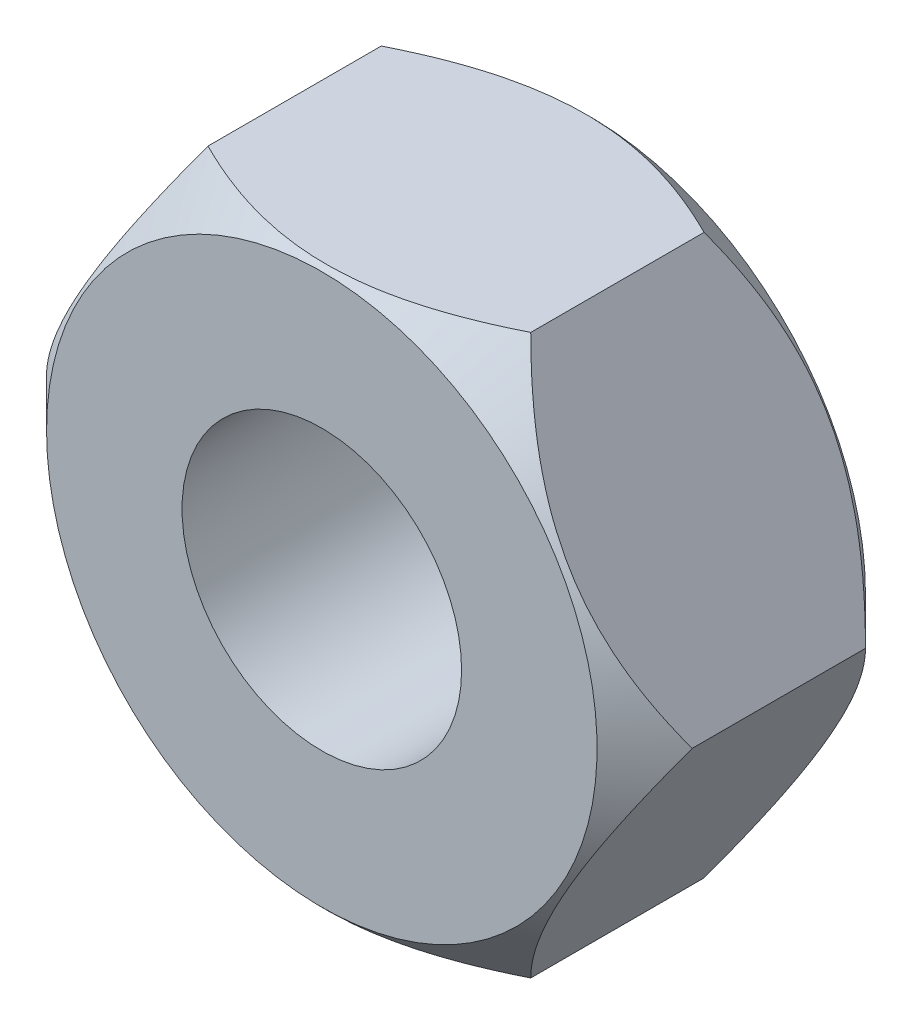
ISO-10303-21;
HEADER;
FILE_DESCRIPTION(('STEP AP214'),'2;1');
FILE_NAME('part.step','',(''),(''),'','','');
FILE_SCHEMA(('AUTOMOTIVE_DESIGN { 1 0 10303 214 1 1 1 1 }'));
ENDSEC;
DATA;
#1=APPLICATION_CONTEXT('core data for automotive mechanical design processes');
#2=APPLICATION_PROTOCOL_DEFINITION('international standard','automotive_design',2000,#1);
#3=PRODUCT_CONTEXT('',#1,'mechanical');
#4=PRODUCT('Part','Part','',(#3));
#5=PRODUCT_RELATED_PRODUCT_CATEGORY('part','',(#4));
#6=PRODUCT_DEFINITION_FORMATION('','',#4);
#7=PRODUCT_DEFINITION_CONTEXT('part definition',#1,'design');
#8=PRODUCT_DEFINITION('design','',#6,#7);
#9=PRODUCT_DEFINITION_SHAPE('','',#8);
#10=(LENGTH_UNIT() NAMED_UNIT(*) SI_UNIT(.MILLI.,.METRE.));
#11=(NAMED_UNIT(*) PLANE_ANGLE_UNIT() SI_UNIT($,.RADIAN.));
#12=(NAMED_UNIT(*) SI_UNIT($,.STERADIAN.) SOLID_ANGLE_UNIT());
#13=UNCERTAINTY_MEASURE_WITH_UNIT(LENGTH_MEASURE(1.E-05),#10,'distance_accuracy_value','');
#14=(GEOMETRIC_REPRESENTATION_CONTEXT(3) GLOBAL_UNCERTAINTY_ASSIGNED_CONTEXT((#13)) GLOBAL_UNIT_ASSIGNED_CONTEXT((#10,
#11,#12)) REPRESENTATION_CONTEXT('',''));
#15=CARTESIAN_POINT('',(0.,0.,0.));
#16=DIRECTION('',(0.,0.,1.));
#17=DIRECTION('',(1.,0.,0.));
#18=AXIS2_PLACEMENT_3D('',#15,#16,#17);
#19=CARTESIAN_POINT('',(-2.88675134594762,5.00000000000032,-4.79999999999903));
#20=DIRECTION('',(-0.866025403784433,0.500000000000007,0.));
#21=DIRECTION('',(-0.500000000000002,-0.866025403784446,0.));
#22=AXIS2_PLACEMENT_3D('',#19,#20,#21);
#23=PLANE('',#22);
#24=CARTESIAN_POINT('',(-5.77361816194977,-0.000199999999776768,-3.94988452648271));
#25=CARTESIAN_POINT('',(-5.72398176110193,0.0857727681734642,-3.9995164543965));
#26=CARTESIAN_POINT('',(-5.67396382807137,0.17240636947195,-4.04762527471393));
#27=CARTESIAN_POINT('',(-5.57309004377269,0.347124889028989,-4.14033336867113));
#28=CARTESIAN_POINT('',(-5.52223375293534,0.435210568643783,-4.18493072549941));
#29=CARTESIAN_POINT('',(-5.36782257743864,0.702658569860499,-4.31314092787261));
#30=CARTESIAN_POINT('',(-5.26296050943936,0.884284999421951,-4.39062493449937));
#31=CARTESIAN_POINT('',(-5.05149774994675,1.25054924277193,-4.52331105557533));
#32=CARTESIAN_POINT('',(-4.94495110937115,1.43509343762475,-4.57884745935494));
#33=CARTESIAN_POINT('',(-4.78337944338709,1.71494377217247,-4.6430895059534));
#34=CARTESIAN_POINT('',(-4.72928433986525,1.80863923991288,-4.66131783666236));
#35=CARTESIAN_POINT('',(-4.62063609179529,1.99682352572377,-4.69100781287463));
#36=CARTESIAN_POINT('',(-4.56608301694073,2.09131222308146,-4.70247046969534));
#37=CARTESIAN_POINT('',(-4.43314578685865,2.32156625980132,-4.72168913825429));
#38=CARTESIAN_POINT('',(-4.3546183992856,2.45757968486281,-4.72572171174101));
#39=CARTESIAN_POINT('',(-4.19770514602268,2.72936141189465,-4.71895414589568));
#40=CARTESIAN_POINT('',(-4.11931933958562,2.86512961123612,-4.70814880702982));
#41=CARTESIAN_POINT('',(-3.96328672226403,3.13538603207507,-4.6723423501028));
#42=CARTESIAN_POINT('',(-3.88564083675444,3.26987265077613,-4.64732535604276));
#43=CARTESIAN_POINT('',(-3.73168360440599,3.53653439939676,-4.58445567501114));
#44=CARTESIAN_POINT('',(-3.65537215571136,3.6687097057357,-4.54660397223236));
#45=CARTESIAN_POINT('',(-3.51990355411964,3.90334820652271,-4.46873011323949));
#46=CARTESIAN_POINT('',(-3.46044647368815,4.00633089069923,-4.43075574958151));
#47=CARTESIAN_POINT('',(-3.34259967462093,4.21044753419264,-4.34868737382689));
#48=CARTESIAN_POINT('',(-3.28420998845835,4.31158143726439,-4.30459317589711));
#49=CARTESIAN_POINT('',(-3.16868188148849,4.51168198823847,-4.21127361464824));
#50=CARTESIAN_POINT('',(-3.11154017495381,4.61065432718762,-4.16206438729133));
#51=CARTESIAN_POINT('',(-2.99831490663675,4.80676624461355,-4.05916087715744));
#52=CARTESIAN_POINT('',(-2.94223072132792,4.90390690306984,-4.00546934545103));
#53=CARTESIAN_POINT('',(-2.88663587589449,5.00020000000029,-3.94988452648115));
#54=B_SPLINE_CURVE_WITH_KNOTS('',3,(#24,#25,#26,#27,#28,#29,#30,#31,#32,#33,#34,#35,#36,#37,#38,
#39,#40,#41,#42,#43,#44,#45,#46,#47,#48,#49,#50,#51,#52,#53),.UNSPECIFIED.,.F.,.F.,(4,2,2,2,2,2,
2,2,2,2,2,2,2,2,4),(0.,0.332945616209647,0.666071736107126,1.33592065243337,1.99513262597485,
2.32409207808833,2.6530023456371,3.12358963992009,3.59434188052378,4.06562104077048,
4.53686407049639,4.91117956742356,5.28550643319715,5.65868635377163,6.03163889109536),.UNSPECIFIED.);
#55=CARTESIAN_POINT('',(-5.77350269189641,4.37150315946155E-13,-3.95000000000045));
#56=VERTEX_POINT('',#55);
#57=CARTESIAN_POINT('',(-2.88675134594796,5.00000000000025,-3.9499999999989));
#58=VERTEX_POINT('',#57);
#59=EDGE_CURVE('E200',#56,#58,#54,.T.);
#60=ORIENTED_EDGE('',*,*,#59,.F.);
#61=DIRECTION('',(0.,0.,1.));
#62=VECTOR('',#61,1.);
#63=CARTESIAN_POINT('',(-5.77350269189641,4.44089209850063E-13,-4.80000000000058));
#64=LINE('',#63,#62);
#65=CARTESIAN_POINT('',(-5.77350269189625,2.63677968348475E-13,-0.850000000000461));
#66=VERTEX_POINT('',#65);
#67=EDGE_CURVE('E44',#56,#66,#64,.T.);
#68=ORIENTED_EDGE('',*,*,#67,.T.);
#69=CARTESIAN_POINT('',(-5.77361816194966,-0.000199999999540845,-0.85011547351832));
#70=CARTESIAN_POINT('',(-5.72398176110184,0.0857727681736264,-0.800483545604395));
#71=CARTESIAN_POINT('',(-5.6739638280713,0.172406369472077,-0.752374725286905));
#72=CARTESIAN_POINT('',(-5.57309004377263,0.347124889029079,-0.65966663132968));
#73=CARTESIAN_POINT('',(-5.52223375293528,0.435210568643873,-0.615069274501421));
#74=CARTESIAN_POINT('',(-5.36782257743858,0.7026585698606,-0.486859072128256));
#75=CARTESIAN_POINT('',(-5.2629605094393,0.884284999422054,-0.409375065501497));
#76=CARTESIAN_POINT('',(-5.05149774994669,1.25054924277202,-0.27668894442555));
#77=CARTESIAN_POINT('',(-4.9449511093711,1.43509343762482,-0.22115254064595));
#78=CARTESIAN_POINT('',(-4.78337944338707,1.71494377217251,-0.156910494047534));
#79=CARTESIAN_POINT('',(-4.72928433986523,1.8086392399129,-0.138682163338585));
#80=CARTESIAN_POINT('',(-4.6206360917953,1.99682352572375,-0.108992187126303));
#81=CARTESIAN_POINT('',(-4.56608301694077,2.09131222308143,-0.0975295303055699));
#82=CARTESIAN_POINT('',(-4.43314578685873,2.32156625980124,-0.0783108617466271));
#83=CARTESIAN_POINT('',(-4.35461839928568,2.45757968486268,-0.0742782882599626));
#84=CARTESIAN_POINT('',(-4.19770514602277,2.72936141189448,-0.0810458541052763));
#85=CARTESIAN_POINT('',(-4.11931933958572,2.86512961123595,-0.0918511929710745));
#86=CARTESIAN_POINT('',(-3.96328672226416,3.13538603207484,-0.127657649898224));
#87=CARTESIAN_POINT('',(-3.88564083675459,3.26987265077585,-0.152674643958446));
#88=CARTESIAN_POINT('',(-3.73168360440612,3.53653439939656,-0.215544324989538));
#89=CARTESIAN_POINT('',(-3.65537215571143,3.66870970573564,-0.253396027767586));
#90=CARTESIAN_POINT('',(-3.5199035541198,3.90334820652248,-0.331269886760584));
#91=CARTESIAN_POINT('',(-3.46044647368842,4.00633089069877,-0.369244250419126));
#92=CARTESIAN_POINT('',(-3.3425996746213,4.21044753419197,-0.451312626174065));
#93=CARTESIAN_POINT('',(-3.28420998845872,4.31158143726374,-0.49540682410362));
#94=CARTESIAN_POINT('',(-3.16868188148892,4.51168198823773,-0.588726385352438));
#95=CARTESIAN_POINT('',(-3.11154017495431,4.61065432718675,-0.63793561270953));
#96=CARTESIAN_POINT('',(-2.9983149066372,4.80676624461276,-0.740839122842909));
#97=CARTESIAN_POINT('',(-2.94223072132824,4.90390690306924,-0.794530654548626));
#98=CARTESIAN_POINT('',(-2.88663587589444,5.00020000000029,-0.850115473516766));
#99=B_SPLINE_CURVE_WITH_KNOTS('',3,(#69,#70,#71,#72,#73,#74,#75,#76,#77,#78,#79,#80,#81,#82,#83,
#84,#85,#86,#87,#88,#89,#90,#91,#92,#93,#94,#95,#96,#97,#98),.UNSPECIFIED.,.F.,.F.,(4,2,2,2,2,2,
2,2,2,2,2,2,2,2,4),(0.,0.332945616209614,0.666071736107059,1.33592065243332,1.99513262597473,
2.32409207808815,2.65300234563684,3.12358963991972,3.59434188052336,4.06562104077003,
4.53686407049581,4.91117956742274,5.28550643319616,5.65868635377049,6.03163889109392),.UNSPECIFIED.);
#100=CARTESIAN_POINT('',(-2.88675134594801,5.00000000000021,-0.849999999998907));
#101=VERTEX_POINT('',#100);
#102=EDGE_CURVE('E131',#66,#101,#99,.T.);
#103=ORIENTED_EDGE('',*,*,#102,.T.);
#104=DIRECTION('',(0.,0.,1.));
#105=VECTOR('',#104,1.);
#106=CARTESIAN_POINT('',(-2.88675134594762,5.00000000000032,-4.79999999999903));
#107=LINE('',#106,#105);
#108=EDGE_CURVE('E11',#58,#101,#107,.T.);
#109=ORIENTED_EDGE('',*,*,#108,.F.);
#110=EDGE_LOOP('',(#60,#68,#103,#109));
#111=FACE_BOUND('',#110,.T.);
#112=ADVANCED_FACE('F40',(#111),#23,.T.);
#113=CARTESIAN_POINT('',(-2.88675134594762,5.00000000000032,-4.79999999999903));
#114=DIRECTION('',(0.,-1.00000000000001,0.));
#115=DIRECTION('',(0.999999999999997,0.,0.));
#116=AXIS2_PLACEMENT_3D('',#113,#114,#115);
#117=PLANE('',#116);
#118=DIRECTION('',(0.,0.,1.));
#119=VECTOR('',#118,1.);
#120=CARTESIAN_POINT('',(2.88675134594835,5.00000000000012,-4.79999999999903));
#121=LINE('',#120,#119);
#122=CARTESIAN_POINT('',(2.88675134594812,5.00000000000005,-3.94999999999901));
#123=VERTEX_POINT('',#122);
#124=CARTESIAN_POINT('',(2.88675134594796,5.0000000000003,-0.849999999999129));
#125=VERTEX_POINT('',#124);
#126=EDGE_CURVE('E49',#123,#125,#121,.T.);
#127=ORIENTED_EDGE('',*,*,#126,.F.);
#128=CARTESIAN_POINT('',(-5.99357629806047,5.0000000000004,-1.91818675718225));
#129=CARTESIAN_POINT('',(-5.8486546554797,5.00000000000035,-2.02944472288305));
#130=CARTESIAN_POINT('',(-5.70294865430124,5.00000000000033,-2.13969712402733));
#131=CARTESIAN_POINT('',(-5.40964860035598,5.00000000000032,-2.35773242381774));
#132=CARTESIAN_POINT('',(-5.26205410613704,5.00000000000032,-2.46551472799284));
#133=CARTESIAN_POINT('',(-4.96357882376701,5.00000000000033,-2.67891856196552));
#134=CARTESIAN_POINT('',(-4.81268146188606,5.00000000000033,-2.78451698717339));
#135=CARTESIAN_POINT('',(-4.50836938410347,5.00000000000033,-2.99200966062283));
#136=CARTESIAN_POINT('',(-4.35495484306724,5.00000000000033,-3.09390416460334));
#137=CARTESIAN_POINT('',(-4.03547909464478,5.00000000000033,-3.29939196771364));
#138=CARTESIAN_POINT('',(-3.86922792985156,5.00000000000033,-3.40269142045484));
#139=CARTESIAN_POINT('',(-3.53282354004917,5.00000000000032,-3.60283631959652));
#140=CARTESIAN_POINT('',(-3.36266966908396,5.00000000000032,-3.69968068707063));
#141=CARTESIAN_POINT('',(-3.01842041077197,5.00000000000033,-3.88484981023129));
#142=CARTESIAN_POINT('',(-2.84433858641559,5.00000000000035,-3.97319958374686));
#143=CARTESIAN_POINT('',(-2.4912729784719,5.0000000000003,-4.13940018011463));
#144=CARTESIAN_POINT('',(-2.31229154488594,5.00000000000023,-4.21725593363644));
#145=CARTESIAN_POINT('',(-1.96661147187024,5.00000000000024,-4.3527670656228));
#146=CARTESIAN_POINT('',(-1.80039807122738,5.0000000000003,-4.41164764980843));
#147=CARTESIAN_POINT('',(-1.46376298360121,5.00000000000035,-4.51610170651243));
#148=CARTESIAN_POINT('',(-1.29334102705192,5.00000000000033,-4.56167432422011));
#149=CARTESIAN_POINT('',(-0.952259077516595,5.00000000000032,-4.63629654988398));
#150=CARTESIAN_POINT('',(-0.781665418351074,5.00000000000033,-4.66564427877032));
#151=CARTESIAN_POINT('',(-0.43839223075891,5.00000000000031,-4.70720899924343));
#152=CARTESIAN_POINT('',(-0.265713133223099,5.00000000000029,-4.71942947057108));
#153=CARTESIAN_POINT('',(0.0725822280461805,5.00000000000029,-4.72571379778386));
#154=CARTESIAN_POINT('',(0.238184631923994,5.00000000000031,-4.72053199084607));
#155=CARTESIAN_POINT('',(0.568083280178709,5.00000000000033,-4.69402264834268));
#156=CARTESIAN_POINT('',(0.732379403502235,5.00000000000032,-4.67269363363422));
#157=CARTESIAN_POINT('',(1.06125983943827,5.00000000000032,-4.61472847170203));
#158=CARTESIAN_POINT('',(1.22579591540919,5.00000000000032,-4.57782321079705));
#159=CARTESIAN_POINT('',(1.55124956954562,5.00000000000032,-4.49074386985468));
#160=CARTESIAN_POINT('',(1.71216736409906,5.0000000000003,-4.44057058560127));
#161=CARTESIAN_POINT('',(2.03985820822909,5.0000000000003,-4.32572275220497));
#162=CARTESIAN_POINT('',(2.20638233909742,5.00000000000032,-4.26034591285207));
#163=CARTESIAN_POINT('',(2.53514333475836,5.00000000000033,-4.11949787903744));
#164=CARTESIAN_POINT('',(2.69737821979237,5.00000000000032,-4.04402211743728));
#165=CARTESIAN_POINT('',(3.01832951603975,5.00000000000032,-3.88476661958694));
#166=CARTESIAN_POINT('',(3.17703310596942,5.00000000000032,-3.80096125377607));
#167=CARTESIAN_POINT('',(3.49080217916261,5.00000000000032,-3.62689160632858));
#168=CARTESIAN_POINT('',(3.64586821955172,5.00000000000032,-3.53662832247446));
#169=CARTESIAN_POINT('',(3.94525494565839,5.00000000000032,-3.35549299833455));
#170=CARTESIAN_POINT('',(4.08972797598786,5.00000000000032,-3.26487142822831));
#171=CARTESIAN_POINT('',(4.37619203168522,5.00000000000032,-3.07977532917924));
#172=CARTESIAN_POINT('',(4.51818286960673,5.00000000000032,-2.98530051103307));
#173=CARTESIAN_POINT('',(4.79886466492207,5.00000000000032,-2.79395544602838));
#174=CARTESIAN_POINT('',(4.9375729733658,5.00000000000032,-2.69711055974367));
#175=CARTESIAN_POINT('',(5.21308736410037,5.00000000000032,-2.50082800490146));
#176=CARTESIAN_POINT('',(5.34989396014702,5.00000000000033,-2.40139105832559));
#177=CARTESIAN_POINT('',(5.48590295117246,5.00000000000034,-2.30089323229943));
#178=B_SPLINE_CURVE_WITH_KNOTS('',3,(#128,#129,#130,#131,#132,#133,#134,#135,#136,#137,#138,
#139,#140,#141,#142,#143,#144,#145,#146,#147,#148,#149,#150,#151,#152,#153,#154,#155,#156,#157,
#158,#159,#160,#161,#162,#163,#164,#165,#166,#167,#168,#169,#170,#171,#172,#173,#174,#175,#176,
#177),.UNSPECIFIED.,.F.,.F.,(4,2,2,2,2,2,2,2,2,2,2,2,2,2,2,2,2,2,2,2,2,2,2,2,4),(0.,
0.548121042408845,1.09637264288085,1.648856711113,2.20130256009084,2.78837599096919,
3.37554730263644,3.96093263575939,4.54604195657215,5.07458825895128,5.60316850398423,
6.12168301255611,6.64009215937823,7.13632490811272,7.63260311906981,8.13783126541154,
8.6430291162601,9.17931060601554,9.71583544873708,10.2540654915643,10.7922125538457,
11.3037682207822,11.8153623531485,12.3228440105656,12.8301857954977),.UNSPECIFIED.);
#179=EDGE_CURVE('E99',#123,#58,#178,.F.);
#180=ORIENTED_EDGE('',*,*,#179,.T.);
#181=ORIENTED_EDGE('',*,*,#108,.T.);
#182=CARTESIAN_POINT('',(-5.99357629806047,5.00000000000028,-2.88181324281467));
#183=CARTESIAN_POINT('',(-5.84865465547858,5.00000000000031,-2.77055527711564));
#184=CARTESIAN_POINT('',(-5.70294865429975,5.00000000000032,-2.66030287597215));
#185=CARTESIAN_POINT('',(-5.40964860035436,5.00000000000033,-2.44226757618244));
#186=CARTESIAN_POINT('',(-5.26205410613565,5.00000000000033,-2.33448527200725));
#187=CARTESIAN_POINT('',(-4.96357882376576,5.00000000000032,-2.12108143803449));
#188=CARTESIAN_POINT('',(-4.81268146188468,5.00000000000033,-2.01548301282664));
#189=CARTESIAN_POINT('',(-4.50836938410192,5.00000000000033,-1.80799033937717));
#190=CARTESIAN_POINT('',(-4.35495484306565,5.00000000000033,-1.70609583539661));
#191=CARTESIAN_POINT('',(-4.03547909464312,5.00000000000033,-1.50060803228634));
#192=CARTESIAN_POINT('',(-3.86922792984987,5.00000000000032,-1.39730857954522));
#193=CARTESIAN_POINT('',(-3.53282354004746,5.00000000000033,-1.19716368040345));
#194=CARTESIAN_POINT('',(-3.36266966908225,5.00000000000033,-1.1003193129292));
#195=CARTESIAN_POINT('',(-3.01842041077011,5.00000000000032,-0.915150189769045));
#196=CARTESIAN_POINT('',(-2.84433858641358,5.00000000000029,-0.826800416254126));
#197=CARTESIAN_POINT('',(-2.49127297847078,5.00000000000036,-0.660599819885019));
#198=CARTESIAN_POINT('',(-2.31229154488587,5.00000000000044,-0.582744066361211));
#199=CARTESIAN_POINT('',(-1.96661147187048,5.00000000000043,-0.447232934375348));
#200=CARTESIAN_POINT('',(-1.80039807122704,5.00000000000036,-0.38835235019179));
#201=CARTESIAN_POINT('',(-1.46376298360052,5.00000000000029,-0.283898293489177));
#202=CARTESIAN_POINT('',(-1.29334102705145,5.0000000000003,-0.238325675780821));
#203=CARTESIAN_POINT('',(-0.952259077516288,5.00000000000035,-0.163703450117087));
#204=CARTESIAN_POINT('',(-0.781665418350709,5.00000000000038,-0.134355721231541));
#205=CARTESIAN_POINT('',(-0.438392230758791,5.00000000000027,-0.0927910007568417));
#206=CARTESIAN_POINT('',(-0.265713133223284,5.00000000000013,-0.0805705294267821));
#207=CARTESIAN_POINT('',(0.0725822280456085,5.00000000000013,-0.074286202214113));
#208=CARTESIAN_POINT('',(0.238184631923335,5.00000000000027,-0.0794680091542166));
#209=CARTESIAN_POINT('',(0.568083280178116,5.00000000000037,-0.105977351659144));
#210=CARTESIAN_POINT('',(0.732379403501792,5.00000000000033,-0.127306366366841));
#211=CARTESIAN_POINT('',(1.06125983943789,5.00000000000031,-0.185271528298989));
#212=CARTESIAN_POINT('',(1.22579591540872,5.00000000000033,-0.222176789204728));
#213=CARTESIAN_POINT('',(1.55124956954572,5.00000000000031,-0.309256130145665));
#214=CARTESIAN_POINT('',(1.71216736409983,5.00000000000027,-0.359429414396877));
#215=CARTESIAN_POINT('',(2.03985820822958,5.00000000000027,-0.474277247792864));
#216=CARTESIAN_POINT('',(2.20638233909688,5.00000000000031,-0.539654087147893));
#217=CARTESIAN_POINT('',(2.53514333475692,5.00000000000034,-0.68050212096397));
#218=CARTESIAN_POINT('',(2.69737821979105,5.00000000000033,-0.755977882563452));
#219=CARTESIAN_POINT('',(3.01832951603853,5.00000000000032,-0.915233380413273));
#220=CARTESIAN_POINT('',(3.17703310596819,5.00000000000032,-0.999038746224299));
#221=CARTESIAN_POINT('',(3.49080217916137,5.00000000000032,-1.17310839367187));
#222=CARTESIAN_POINT('',(3.64586821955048,5.00000000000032,-1.26337167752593));
#223=CARTESIAN_POINT('',(3.9452549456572,5.00000000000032,-1.44450700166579));
#224=CARTESIAN_POINT('',(4.08972797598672,5.00000000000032,-1.53512857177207));
#225=CARTESIAN_POINT('',(4.37619203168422,5.00000000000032,-1.72022467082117));
#226=CARTESIAN_POINT('',(4.51818286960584,5.00000000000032,-1.81469948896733));
#227=CARTESIAN_POINT('',(4.79886466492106,5.00000000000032,-2.00604455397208));
#228=CARTESIAN_POINT('',(4.93757297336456,5.00000000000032,-2.10288944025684));
#229=CARTESIAN_POINT('',(5.21308736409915,5.00000000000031,-2.29917199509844));
#230=CARTESIAN_POINT('',(5.34989396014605,5.0000000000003,-2.39860894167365));
#231=CARTESIAN_POINT('',(5.48590295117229,5.00000000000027,-2.49910676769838));
#232=B_SPLINE_CURVE_WITH_KNOTS('',3,(#182,#183,#184,#185,#186,#187,#188,#189,#190,#191,#192,
#193,#194,#195,#196,#197,#198,#199,#200,#201,#202,#203,#204,#205,#206,#207,#208,#209,#210,#211,
#212,#213,#214,#215,#216,#217,#218,#219,#220,#221,#222,#223,#224,#225,#226,#227,#228,#229,#230,
#231),.UNSPECIFIED.,.F.,.F.,(4,2,2,2,2,2,2,2,2,2,2,2,2,2,2,2,2,2,2,2,2,2,2,2,4),(0.,
0.548121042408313,1.0963726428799,1.64885671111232,2.20130256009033,2.78837599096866,
3.37554730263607,3.96093263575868,4.5460419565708,5.07458825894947,5.60316850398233,
6.12168301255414,6.64009215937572,7.13632490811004,7.63260311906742,8.13783126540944,
8.6430291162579,9.17931060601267,9.71583544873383,10.2540654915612,10.7922125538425,
11.3037682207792,11.8153623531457,12.3228440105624,12.8301857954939),.UNSPECIFIED.);
#233=EDGE_CURVE('E139',#125,#101,#232,.F.);
#234=ORIENTED_EDGE('',*,*,#233,.F.);
#235=EDGE_LOOP('',(#127,#180,#181,#234));
#236=FACE_BOUND('',#235,.T.);
#237=ADVANCED_FACE('F183',(#236),#117,.F.);
#238=CARTESIAN_POINT('',(2.88675134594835,5.00000000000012,-4.79999999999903));
#239=DIRECTION('',(-0.866025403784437,-0.500000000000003,0.));
#240=DIRECTION('',(0.499999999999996,-0.866025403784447,0.));
#241=AXIS2_PLACEMENT_3D('',#238,#239,#240);
#242=PLANE('',#241);
#243=DIRECTION('',(0.,0.,1.));
#244=VECTOR('',#243,1.);
#245=CARTESIAN_POINT('',(5.77350269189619,2.0122792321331E-13,-4.80000000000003));
#246=LINE('',#245,#244);
#247=CARTESIAN_POINT('',(5.77350269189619,1.66533453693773E-13,-3.95000000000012));
#248=VERTEX_POINT('',#247);
#249=CARTESIAN_POINT('',(5.77350269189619,1.73472347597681E-13,-0.850000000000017));
#250=VERTEX_POINT('',#249);
#251=EDGE_CURVE('E108',#248,#250,#246,.T.);
#252=ORIENTED_EDGE('',*,*,#251,.F.);
#253=CARTESIAN_POINT('',(5.77361816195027,-0.000199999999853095,-3.94988452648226));
#254=CARTESIAN_POINT('',(5.72398176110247,0.0857727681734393,-3.99951645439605));
#255=CARTESIAN_POINT('',(5.67396382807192,0.172406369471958,-4.04762527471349));
#256=CARTESIAN_POINT('',(5.57309004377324,0.347124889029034,-4.14033336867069));
#257=CARTESIAN_POINT('',(5.52223375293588,0.435210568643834,-4.18493072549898));
#258=CARTESIAN_POINT('',(5.36782257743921,0.702658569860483,-4.31314092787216));
#259=CARTESIAN_POINT('',(5.26296050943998,0.884284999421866,-4.39062493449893));
#260=CARTESIAN_POINT('',(5.05149774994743,1.25054924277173,-4.52331105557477));
#261=CARTESIAN_POINT('',(4.94495110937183,1.43509343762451,-4.57884745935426));
#262=CARTESIAN_POINT('',(4.78337944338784,1.71494377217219,-4.64308950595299));
#263=CARTESIAN_POINT('',(4.72928433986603,1.80863923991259,-4.66131783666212));
#264=CARTESIAN_POINT('',(4.62063609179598,1.99682352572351,-4.69100781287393));
#265=CARTESIAN_POINT('',(4.56608301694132,2.09131222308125,-4.70247046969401));
#266=CARTESIAN_POINT('',(4.43314578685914,2.32156625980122,-4.72168913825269));
#267=CARTESIAN_POINT('',(4.35461839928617,2.45757968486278,-4.7257217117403));
#268=CARTESIAN_POINT('',(4.19770514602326,2.7293614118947,-4.71895414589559));
#269=CARTESIAN_POINT('',(4.11931933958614,2.86512961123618,-4.70814880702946));
#270=CARTESIAN_POINT('',(3.96328672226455,3.13538603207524,-4.67234235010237));
#271=CARTESIAN_POINT('',(3.88564083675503,3.26987265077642,-4.64732535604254));
#272=CARTESIAN_POINT('',(3.73168360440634,3.53653439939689,-4.58445567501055));
#273=CARTESIAN_POINT('',(3.65537215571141,3.66870970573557,-4.54660397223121));
#274=CARTESIAN_POINT('',(3.51990355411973,3.9033482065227,-4.46873011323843));
#275=CARTESIAN_POINT('',(3.46044647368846,4.00633089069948,-4.43075574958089));
#276=CARTESIAN_POINT('',(3.34259967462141,4.21044753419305,-4.34868737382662));
#277=CARTESIAN_POINT('',(3.28420998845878,4.3115814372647,-4.30459317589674));
#278=CARTESIAN_POINT('',(3.16868188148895,4.51168198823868,-4.2112736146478));
#279=CARTESIAN_POINT('',(3.11154017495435,4.61065432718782,-4.1620643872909));
#280=CARTESIAN_POINT('',(2.99831490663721,4.8067662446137,-4.05916087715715));
#281=CARTESIAN_POINT('',(2.94223072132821,4.90390690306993,-4.00546934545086));
#282=CARTESIAN_POINT('',(2.88663587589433,5.0002000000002,-3.94988452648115));
#283=B_SPLINE_CURVE_WITH_KNOTS('',3,(#253,#254,#255,#256,#257,#258,#259,#260,#261,#262,#263,
#264,#265,#266,#267,#268,#269,#270,#271,#272,#273,#274,#275,#276,#277,#278,#279,#280,#281,#282),
.UNSPECIFIED.,.F.,.F.,(4,2,2,2,2,2,2,2,2,2,2,2,2,2,4),(0.,0.332945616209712,0.666071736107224,
1.3359206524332,1.99513262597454,2.32409207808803,2.65300234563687,3.12358963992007,
3.59434188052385,4.06562104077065,4.53686407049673,4.91117956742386,5.28550643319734,
5.6586863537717,6.03163889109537),.UNSPECIFIED.);
#284=EDGE_CURVE('E93',#248,#123,#283,.T.);
#285=ORIENTED_EDGE('',*,*,#284,.T.);
#286=ORIENTED_EDGE('',*,*,#126,.T.);
#287=CARTESIAN_POINT('',(5.77361816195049,-0.000199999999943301,-0.850115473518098));
#288=CARTESIAN_POINT('',(5.72398176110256,0.0857727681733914,-0.800483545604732));
#289=CARTESIAN_POINT('',(5.67396382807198,0.172406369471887,-0.752374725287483));
#290=CARTESIAN_POINT('',(5.57309004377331,0.347124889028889,-0.659666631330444));
#291=CARTESIAN_POINT('',(5.52223375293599,0.435210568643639,-0.615069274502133));
#292=CARTESIAN_POINT('',(5.36782257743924,0.702658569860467,-0.486859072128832));
#293=CARTESIAN_POINT('',(5.26296050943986,0.884284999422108,-0.409375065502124));
#294=CARTESIAN_POINT('',(5.05149774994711,1.25054924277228,-0.276688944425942));
#295=CARTESIAN_POINT('',(4.94495110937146,1.4350934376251,-0.221152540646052));
#296=CARTESIAN_POINT('',(4.78337944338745,1.71494377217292,-0.156910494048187));
#297=CARTESIAN_POINT('',(4.72928433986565,1.80863923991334,-0.138682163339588));
#298=CARTESIAN_POINT('',(4.62063609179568,1.99682352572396,-0.108992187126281));
#299=CARTESIAN_POINT('',(4.56608301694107,2.09131222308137,-0.0975295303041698));
#300=CARTESIAN_POINT('',(4.43314578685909,2.32156625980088,-0.078310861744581));
#301=CARTESIAN_POINT('',(4.35461839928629,2.45757968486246,-0.0742782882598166));
#302=CARTESIAN_POINT('',(4.19770514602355,2.72936141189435,-0.0810458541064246));
#303=CARTESIAN_POINT('',(4.11931933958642,2.86512961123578,-0.0918511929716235));
#304=CARTESIAN_POINT('',(3.96328672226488,3.1353860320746,-0.127657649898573));
#305=CARTESIAN_POINT('',(3.88564083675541,3.26987265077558,-0.152674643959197));
#306=CARTESIAN_POINT('',(3.73168360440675,3.53653439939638,-0.215544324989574));
#307=CARTESIAN_POINT('',(3.6553721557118,3.66870970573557,-0.253396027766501));
#308=CARTESIAN_POINT('',(3.51990355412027,3.90334820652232,-0.331269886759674));
#309=CARTESIAN_POINT('',(3.46044647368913,4.00633089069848,-0.369244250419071));
#310=CARTESIAN_POINT('',(3.34259967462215,4.21044753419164,-0.451312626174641));
#311=CARTESIAN_POINT('',(3.28420998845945,4.31158143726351,-0.495406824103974));
#312=CARTESIAN_POINT('',(3.16868188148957,4.51168198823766,-0.58872638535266));
#313=CARTESIAN_POINT('',(3.11154017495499,4.61065432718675,-0.637935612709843));
#314=CARTESIAN_POINT('',(2.99831490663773,4.80676624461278,-0.740839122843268));
#315=CARTESIAN_POINT('',(2.9422307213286,4.90390690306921,-0.794530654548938));
#316=CARTESIAN_POINT('',(2.88663587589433,5.00020000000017,-0.850115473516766));
#317=B_SPLINE_CURVE_WITH_KNOTS('',3,(#287,#288,#289,#290,#291,#292,#293,#294,#295,#296,#297,
#298,#299,#300,#301,#302,#303,#304,#305,#306,#307,#308,#309,#310,#311,#312,#313,#314,#315,#316),
.UNSPECIFIED.,.F.,.F.,(4,2,2,2,2,2,2,2,2,2,2,2,2,2,4),(0.,0.332945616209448,0.666071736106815,
1.33592065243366,1.99513262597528,2.32409207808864,2.65300234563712,3.12358963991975,
3.59434188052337,4.06562104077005,4.53686407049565,4.91117956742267,5.28550643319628,
5.65868635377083,6.03163889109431),.UNSPECIFIED.);
#318=EDGE_CURVE('E115',#250,#125,#317,.T.);
#319=ORIENTED_EDGE('',*,*,#318,.F.);
#320=EDGE_LOOP('',(#252,#285,#286,#319));
#321=FACE_BOUND('',#320,.T.);
#322=ADVANCED_FACE('F113',(#321),#242,.F.);
#323=CARTESIAN_POINT('',(5.77350269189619,2.0122792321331E-13,-4.80000000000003));
#324=DIRECTION('',(-0.866025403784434,0.500000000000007,0.));
#325=DIRECTION('',(-0.500000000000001,-0.866025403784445,0.));
#326=AXIS2_PLACEMENT_3D('',#323,#324,#325);
#327=PLANE('',#326);
#328=DIRECTION('',(0.,0.,1.));
#329=VECTOR('',#328,1.);
#330=CARTESIAN_POINT('',(2.88675134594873,-5.00000000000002,-4.80000000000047));
#331=LINE('',#330,#329);
#332=CARTESIAN_POINT('',(2.88675134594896,-4.99999999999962,-3.95000000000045));
#333=VERTEX_POINT('',#332);
#334=CARTESIAN_POINT('',(2.88675134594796,-4.99999999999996,-0.85000000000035));
#335=VERTEX_POINT('',#334);
#336=EDGE_CURVE('E110',#333,#335,#331,.T.);
#337=ORIENTED_EDGE('',*,*,#336,.F.);
#338=CARTESIAN_POINT('',(2.88663587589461,-5.00019999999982,-3.94988452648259));
#339=CARTESIAN_POINT('',(2.93627227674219,-4.91422723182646,-3.99951645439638));
#340=CARTESIAN_POINT('',(2.98629020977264,-4.82759363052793,-4.04762527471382));
#341=CARTESIAN_POINT('',(3.08716399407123,-4.65287511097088,-4.140333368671));
#342=CARTESIAN_POINT('',(3.1380202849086,-4.56478943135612,-4.18493072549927));
#343=CARTESIAN_POINT('',(3.29243146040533,-4.29734143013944,-4.31314092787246));
#344=CARTESIAN_POINT('',(3.39729352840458,-4.11571500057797,-4.39062493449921));
#345=CARTESIAN_POINT('',(3.60875628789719,-3.74945075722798,-4.5233110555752));
#346=CARTESIAN_POINT('',(3.71530292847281,-3.56490656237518,-4.57884745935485));
#347=CARTESIAN_POINT('',(3.87687459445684,-3.28505622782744,-4.64308950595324));
#348=CARTESIAN_POINT('',(3.93096969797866,-3.19136076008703,-4.66131783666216));
#349=CARTESIAN_POINT('',(4.03961794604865,-3.0031764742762,-4.69100781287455));
#350=CARTESIAN_POINT('',(4.09417102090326,-2.90868777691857,-4.70247046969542));
#351=CARTESIAN_POINT('',(4.22710825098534,-2.67843374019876,-4.72168913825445));
#352=CARTESIAN_POINT('',(4.3056356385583,-2.54242031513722,-4.72572171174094));
#353=CARTESIAN_POINT('',(4.4625488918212,-2.27063858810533,-4.7189541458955));
#354=CARTESIAN_POINT('',(4.54093469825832,-2.13487038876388,-4.70814880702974));
#355=CARTESIAN_POINT('',(4.69696731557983,-1.86461396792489,-4.67234235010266));
#356=CARTESIAN_POINT('',(4.77461320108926,-1.73012734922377,-4.64732535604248));
#357=CARTESIAN_POINT('',(4.92857043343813,-1.46346560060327,-4.58445567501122));
#358=CARTESIAN_POINT('',(5.00488188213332,-1.3312902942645,-4.54660397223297));
#359=CARTESIAN_POINT('',(5.14035048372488,-1.09665179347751,-4.46873011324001));
#360=CARTESIAN_POINT('',(5.19980756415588,-0.993669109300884,-4.43075574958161));
#361=CARTESIAN_POINT('',(5.31765436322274,-0.789552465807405,-4.34868737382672));
#362=CARTESIAN_POINT('',(5.37604404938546,-0.688418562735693,-4.30459317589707));
#363=CARTESIAN_POINT('',(5.49157215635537,-0.488318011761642,-4.21127361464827));
#364=CARTESIAN_POINT('',(5.54871386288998,-0.389345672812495,-4.16206438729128));
#365=CARTESIAN_POINT('',(5.66193913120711,-0.193233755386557,-4.05916087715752));
#366=CARTESIAN_POINT('',(5.71802331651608,-0.0960930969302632,-4.00546934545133));
#367=CARTESIAN_POINT('',(5.77361816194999,0.000200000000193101,-3.94988452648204));
#368=B_SPLINE_CURVE_WITH_KNOTS('',3,(#338,#339,#340,#341,#342,#343,#344,#345,#346,#347,#348,
#349,#350,#351,#352,#353,#354,#355,#356,#357,#358,#359,#360,#361,#362,#363,#364,#365,#366,#367),
.UNSPECIFIED.,.F.,.F.,(4,2,2,2,2,2,2,2,2,2,2,2,2,2,4),(0.,0.332945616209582,0.666071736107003,
1.33592065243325,1.99513262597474,2.3240920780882,2.65300234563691,3.12358963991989,
3.59434188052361,4.06562104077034,4.53686407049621,4.9111795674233,5.28550643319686,
5.65868635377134,6.03163889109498),.UNSPECIFIED.);
#369=EDGE_CURVE('E97',#333,#248,#368,.T.);
#370=ORIENTED_EDGE('',*,*,#369,.T.);
#371=ORIENTED_EDGE('',*,*,#251,.T.);
#372=CARTESIAN_POINT('',(2.88663587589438,-5.00020000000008,-0.85011547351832));
#373=CARTESIAN_POINT('',(2.93627227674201,-4.91422723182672,-0.800483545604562));
#374=CARTESIAN_POINT('',(2.98629020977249,-4.8275936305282,-0.752374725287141));
#375=CARTESIAN_POINT('',(3.08716399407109,-4.65287511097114,-0.659666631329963));
#376=CARTESIAN_POINT('',(3.13802028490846,-4.56478943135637,-0.615069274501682));
#377=CARTESIAN_POINT('',(3.29243146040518,-4.29734143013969,-0.486859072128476));
#378=CARTESIAN_POINT('',(3.39729352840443,-4.11571500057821,-0.409375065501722));
#379=CARTESIAN_POINT('',(3.60875628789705,-3.74945075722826,-0.276688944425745));
#380=CARTESIAN_POINT('',(3.71530292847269,-3.5649065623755,-0.221152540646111));
#381=CARTESIAN_POINT('',(3.87687459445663,-3.28505622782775,-0.156910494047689));
#382=CARTESIAN_POINT('',(3.93096969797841,-3.19136076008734,-0.138682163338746));
#383=CARTESIAN_POINT('',(4.03961794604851,-3.00317647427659,-0.108992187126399));
#384=CARTESIAN_POINT('',(4.09417102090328,-2.90868777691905,-0.0975295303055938));
#385=CARTESIAN_POINT('',(4.22710825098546,-2.67843374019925,-0.0783108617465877));
#386=CARTESIAN_POINT('',(4.30563563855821,-2.54242031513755,-0.0742782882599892));
#387=CARTESIAN_POINT('',(4.46254889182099,-2.2706385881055,-0.081045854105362));
#388=CARTESIAN_POINT('',(4.54093469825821,-2.13487038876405,-0.091851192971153));
#389=CARTESIAN_POINT('',(4.69696731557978,-1.86461396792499,-0.127657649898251));
#390=CARTESIAN_POINT('',(4.77461320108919,-1.7301273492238,-0.15267464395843));
#391=CARTESIAN_POINT('',(4.92857043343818,-1.46346560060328,-0.215544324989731));
#392=CARTESIAN_POINT('',(5.00488188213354,-1.33129029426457,-0.253396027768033));
#393=CARTESIAN_POINT('',(5.14035048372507,-1.09665179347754,-0.331269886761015));
#394=CARTESIAN_POINT('',(5.19980756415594,-0.993669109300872,-0.369244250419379));
#395=CARTESIAN_POINT('',(5.3176543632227,-0.789552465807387,-0.451312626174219));
#396=CARTESIAN_POINT('',(5.37604404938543,-0.688418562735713,-0.495406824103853));
#397=CARTESIAN_POINT('',(5.49157215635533,-0.488318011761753,-0.588726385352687));
#398=CARTESIAN_POINT('',(5.5487138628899,-0.389345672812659,-0.637935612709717));
#399=CARTESIAN_POINT('',(5.66193913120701,-0.193233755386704,-0.740839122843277));
#400=CARTESIAN_POINT('',(5.718023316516,-0.0960930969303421,-0.794530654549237));
#401=CARTESIAN_POINT('',(5.77361816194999,0.000200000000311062,-0.850115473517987));
#402=B_SPLINE_CURVE_WITH_KNOTS('',3,(#372,#373,#374,#375,#376,#377,#378,#379,#380,#381,#382,
#383,#384,#385,#386,#387,#388,#389,#390,#391,#392,#393,#394,#395,#396,#397,#398,#399,#400,#401),
.UNSPECIFIED.,.F.,.F.,(4,2,2,2,2,2,2,2,2,2,2,2,2,2,4),(0.,0.332945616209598,0.666071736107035,
1.33592065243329,1.9951326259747,2.32409207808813,2.65300234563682,3.12358963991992,
3.59434188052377,4.06562104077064,4.53686407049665,4.91117956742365,5.28550643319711,
5.65868635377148,6.03163889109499),.UNSPECIFIED.);
#403=EDGE_CURVE('E172',#335,#250,#402,.T.);
#404=ORIENTED_EDGE('',*,*,#403,.F.);
#405=EDGE_LOOP('',(#337,#370,#371,#404));
#406=FACE_BOUND('',#405,.T.);
#407=ADVANCED_FACE('F106',(#406),#327,.F.);
#408=CARTESIAN_POINT('',(-2.88675134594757,-4.99999999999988,-4.80000000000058));
#409=DIRECTION('',(0.,-1.00000000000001,0.));
#410=DIRECTION('',(0.999999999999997,0.,0.));
#411=AXIS2_PLACEMENT_3D('',#408,#409,#410);
#412=PLANE('',#411);
#413=CARTESIAN_POINT('',(-5.99357629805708,-4.9999999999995,-1.91818675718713));
#414=CARTESIAN_POINT('',(-5.84865465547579,-4.99999999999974,-2.02944472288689));
#415=CARTESIAN_POINT('',(-5.70294865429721,-4.99999999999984,-2.13969712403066));
#416=CARTESIAN_POINT('',(-5.40964860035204,-4.99999999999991,-2.35773242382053));
#417=CARTESIAN_POINT('',(-5.2620541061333,-4.99999999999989,-2.4655147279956));
#418=CARTESIAN_POINT('',(-4.96357882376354,-4.99999999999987,-2.67891856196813));
#419=CARTESIAN_POINT('',(-4.81268146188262,-4.99999999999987,-2.78451698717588));
#420=CARTESIAN_POINT('',(-4.50836938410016,-4.99999999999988,-2.99200966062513));
#421=CARTESIAN_POINT('',(-4.35495484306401,-4.99999999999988,-3.09390416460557));
#422=CARTESIAN_POINT('',(-4.03547909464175,-4.99999999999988,-3.29939196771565));
#423=CARTESIAN_POINT('',(-3.86922792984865,-4.99999999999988,-3.4026914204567));
#424=CARTESIAN_POINT('',(-3.53282354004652,-4.99999999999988,-3.60283631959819));
#425=CARTESIAN_POINT('',(-3.36266966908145,-4.99999999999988,-3.69968068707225));
#426=CARTESIAN_POINT('',(-3.01842041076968,-4.99999999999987,-3.88484981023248));
#427=CARTESIAN_POINT('',(-2.84433858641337,-4.99999999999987,-3.97319958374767));
#428=CARTESIAN_POINT('',(-2.49127297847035,-4.99999999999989,-4.13940018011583));
#429=CARTESIAN_POINT('',(-2.31229154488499,-4.99999999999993,-4.21725593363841));
#430=CARTESIAN_POINT('',(-1.96661147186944,-4.99999999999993,-4.35276706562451));
#431=CARTESIAN_POINT('',(-1.80039807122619,-4.9999999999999,-4.41164764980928));
#432=CARTESIAN_POINT('',(-1.46376298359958,-4.99999999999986,-4.5161017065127));
#433=CARTESIAN_POINT('',(-1.29334102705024,-4.99999999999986,-4.56167432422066));
#434=CARTESIAN_POINT('',(-0.952259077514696,-4.9999999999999,-4.63629654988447));
#435=CARTESIAN_POINT('',(-0.781665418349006,-4.99999999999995,-4.66564427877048));
#436=CARTESIAN_POINT('',(-0.438392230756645,-4.99999999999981,-4.70720899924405));
#437=CARTESIAN_POINT('',(-0.265713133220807,-4.99999999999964,-4.71942947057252));
#438=CARTESIAN_POINT('',(0.0725822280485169,-4.99999999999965,-4.72571379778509));
#439=CARTESIAN_POINT('',(0.238184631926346,-4.99999999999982,-4.72053199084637));
#440=CARTESIAN_POINT('',(0.568083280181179,-4.99999999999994,-4.69402264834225));
#441=CARTESIAN_POINT('',(0.732379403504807,-4.99999999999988,-4.67269363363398));
#442=CARTESIAN_POINT('',(1.06125983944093,-4.99999999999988,-4.61472847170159));
#443=CARTESIAN_POINT('',(1.22579591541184,-4.99999999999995,-4.57782321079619));
#444=CARTESIAN_POINT('',(1.55124956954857,-4.99999999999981,-4.49074386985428));
#445=CARTESIAN_POINT('',(1.71216736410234,-4.9999999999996,-4.44057058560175));
#446=CARTESIAN_POINT('',(2.03985820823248,-4.99999999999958,-4.32572275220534));
#447=CARTESIAN_POINT('',(2.20638233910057,-4.9999999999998,-4.26034591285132));
#448=CARTESIAN_POINT('',(2.53514333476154,-4.99999999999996,-4.1194978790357));
#449=CARTESIAN_POINT('',(2.6973782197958,-4.9999999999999,-4.04402211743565));
#450=CARTESIAN_POINT('',(3.01832951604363,-4.99999999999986,-3.88476661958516));
#451=CARTESIAN_POINT('',(3.17703310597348,-4.99999999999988,-3.80096125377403));
#452=CARTESIAN_POINT('',(3.49080217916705,-4.99999999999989,-3.62689160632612));
#453=CARTESIAN_POINT('',(3.64586821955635,-4.99999999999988,-3.53662832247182));
#454=CARTESIAN_POINT('',(3.9452549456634,-4.99999999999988,-3.35549299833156));
#455=CARTESIAN_POINT('',(4.08972797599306,-4.99999999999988,-3.26487142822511));
#456=CARTESIAN_POINT('',(4.37619203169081,-4.99999999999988,-3.07977532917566));
#457=CARTESIAN_POINT('',(4.51818286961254,-4.99999999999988,-2.98530051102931));
#458=CARTESIAN_POINT('',(4.79886466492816,-4.99999999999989,-2.79395544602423));
#459=CARTESIAN_POINT('',(4.93757297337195,-4.9999999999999,-2.69711055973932));
#460=CARTESIAN_POINT('',(5.21308736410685,-4.99999999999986,-2.50082800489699));
#461=CARTESIAN_POINT('',(5.34989396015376,-4.9999999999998,-2.4013910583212));
#462=CARTESIAN_POINT('',(5.48590295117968,-4.99999999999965,-2.30089323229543));
#463=B_SPLINE_CURVE_WITH_KNOTS('',3,(#413,#414,#415,#416,#417,#418,#419,#420,#421,#422,#423,
#424,#425,#426,#427,#428,#429,#430,#431,#432,#433,#434,#435,#436,#437,#438,#439,#440,#441,#442,
#443,#444,#445,#446,#447,#448,#449,#450,#451,#452,#453,#454,#455,#456,#457,#458,#459,#460,#461,
#462),.UNSPECIFIED.,.F.,.F.,(4,2,2,2,2,2,2,2,2,2,2,2,2,2,2,2,2,2,2,2,2,2,2,2,4),(0.,
0.548121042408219,1.09637264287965,1.64885671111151,2.20130256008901,2.78837599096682,
3.37554730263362,3.96093263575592,4.54604195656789,5.07458825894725,5.60316850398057,
6.12168301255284,6.64009215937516,7.13632490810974,7.6326031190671,8.13783126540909,
8.64302911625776,9.1793106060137,9.71583544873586,10.254065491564,10.792212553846,
11.3037682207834,11.8153623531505,12.3228440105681,12.8301857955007),.UNSPECIFIED.);
#464=CARTESIAN_POINT('',(-2.88675134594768,-4.99999999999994,-3.95000000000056));
#465=VERTEX_POINT('',#464);
#466=EDGE_CURVE('E57',#333,#465,#463,.F.);
#467=ORIENTED_EDGE('',*,*,#466,.F.);
#468=ORIENTED_EDGE('',*,*,#336,.T.);
#469=CARTESIAN_POINT('',(-5.99357629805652,-4.99999999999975,-2.88181324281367));
#470=CARTESIAN_POINT('',(-5.8486546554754,-4.99999999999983,-2.77055527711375));
#471=CARTESIAN_POINT('',(-5.70294865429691,-4.99999999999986,-2.66030287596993));
#472=CARTESIAN_POINT('',(-5.40964860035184,-4.99999999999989,-2.44226757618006));
#473=CARTESIAN_POINT('',(-5.26205410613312,-4.99999999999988,-2.33448527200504));
#474=CARTESIAN_POINT('',(-4.96357882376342,-4.99999999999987,-2.12108143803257));
#475=CARTESIAN_POINT('',(-4.81268146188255,-4.99999999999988,-2.01548301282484));
#476=CARTESIAN_POINT('',(-4.50836938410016,-4.99999999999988,-1.80799033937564));
#477=CARTESIAN_POINT('',(-4.35495484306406,-4.99999999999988,-1.70609583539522));
#478=CARTESIAN_POINT('',(-4.03547909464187,-4.99999999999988,-1.50060803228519));
#479=CARTESIAN_POINT('',(-3.86922792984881,-4.99999999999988,-1.39730857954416));
#480=CARTESIAN_POINT('',(-3.53282354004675,-4.99999999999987,-1.19716368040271));
#481=CARTESIAN_POINT('',(-3.36266966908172,-4.99999999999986,-1.10031931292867));
#482=CARTESIAN_POINT('',(-3.01842041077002,-4.9999999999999,-0.915150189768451));
#483=CARTESIAN_POINT('',(-2.84433858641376,-4.99999999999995,-0.826800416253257));
#484=CARTESIAN_POINT('',(-2.4912729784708,-4.99999999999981,-0.660599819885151));
#485=CARTESIAN_POINT('',(-2.31229154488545,-4.99999999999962,-0.582744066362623));
#486=CARTESIAN_POINT('',(-1.96661147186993,-4.99999999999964,-0.44723293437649));
#487=CARTESIAN_POINT('',(-1.80039807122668,-4.99999999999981,-0.388352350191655));
#488=CARTESIAN_POINT('',(-1.46376298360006,-4.99999999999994,-0.283898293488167));
#489=CARTESIAN_POINT('',(-1.29334102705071,-4.99999999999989,-0.23832567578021));
#490=CARTESIAN_POINT('',(-0.952259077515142,-4.99999999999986,-0.16370345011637));
#491=CARTESIAN_POINT('',(-0.781665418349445,-4.99999999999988,-0.134355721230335));
#492=CARTESIAN_POINT('',(-0.438392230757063,-4.99999999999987,-0.0927910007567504));
#493=CARTESIAN_POINT('',(-0.26571313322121,-4.99999999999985,-0.080570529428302));
#494=CARTESIAN_POINT('',(0.0725822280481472,-4.99999999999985,-0.0742862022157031));
#495=CARTESIAN_POINT('',(0.238184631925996,-4.99999999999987,-0.079468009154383));
#496=CARTESIAN_POINT('',(0.56808328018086,-4.99999999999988,-0.105977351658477));
#497=CARTESIAN_POINT('',(0.732379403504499,-4.99999999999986,-0.127306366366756));
#498=CARTESIAN_POINT('',(1.06125983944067,-4.99999999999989,-0.185271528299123));
#499=CARTESIAN_POINT('',(1.2257959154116,-4.99999999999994,-0.222176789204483));
#500=CARTESIAN_POINT('',(1.55124956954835,-4.99999999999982,-0.309256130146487));
#501=CARTESIAN_POINT('',(1.71216736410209,-4.99999999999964,-0.359429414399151));
#502=CARTESIAN_POINT('',(2.0398582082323,-4.99999999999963,-0.474277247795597));
#503=CARTESIAN_POINT('',(2.20638233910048,-4.99999999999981,-0.539654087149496));
#504=CARTESIAN_POINT('',(2.53514333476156,-4.99999999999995,-0.68050212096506));
#505=CARTESIAN_POINT('',(2.69737821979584,-4.9999999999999,-0.755977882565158));
#506=CARTESIAN_POINT('',(3.01832951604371,-4.99999999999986,-0.915233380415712));
#507=CARTESIAN_POINT('',(3.17703310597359,-4.99999999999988,-0.999038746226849));
#508=CARTESIAN_POINT('',(3.49080217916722,-4.99999999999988,-1.1731083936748));
#509=CARTESIAN_POINT('',(3.64586821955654,-4.99999999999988,-1.26337167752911));
#510=CARTESIAN_POINT('',(3.94525494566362,-4.99999999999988,-1.44450700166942));
#511=CARTESIAN_POINT('',(4.08972797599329,-4.99999999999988,-1.53512857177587));
#512=CARTESIAN_POINT('',(4.37619203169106,-4.99999999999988,-1.72022467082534));
#513=CARTESIAN_POINT('',(4.5181828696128,-4.99999999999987,-1.81469948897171));
#514=CARTESIAN_POINT('',(4.79886466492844,-4.99999999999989,-2.00604455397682));
#515=CARTESIAN_POINT('',(4.93757297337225,-4.99999999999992,-2.10288944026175));
#516=CARTESIAN_POINT('',(5.21308736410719,-4.99999999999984,-2.2991719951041));
#517=CARTESIAN_POINT('',(5.34989396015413,-4.99999999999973,-2.39860894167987));
#518=CARTESIAN_POINT('',(5.48590295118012,-4.99999999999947,-2.49910676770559));
#519=B_SPLINE_CURVE_WITH_KNOTS('',3,(#469,#470,#471,#472,#473,#474,#475,#476,#477,#478,#479,
#480,#481,#482,#483,#484,#485,#486,#487,#488,#489,#490,#491,#492,#493,#494,#495,#496,#497,#498,
#499,#500,#501,#502,#503,#504,#505,#506,#507,#508,#509,#510,#511,#512,#513,#514,#515,#516,#517,
#518),.UNSPECIFIED.,.F.,.F.,(4,2,2,2,2,2,2,2,2,2,2,2,2,2,2,2,2,2,2,2,2,2,2,2,4),(0.,
0.548121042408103,1.09637264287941,1.64885671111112,2.20130256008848,2.78837599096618,
3.37554730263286,3.96093263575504,4.54604195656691,5.07458825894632,5.60316850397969,
6.12168301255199,6.64009215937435,7.13632490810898,7.63260311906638,8.13783126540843,
8.64302911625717,9.17931060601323,9.7158354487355,10.2540654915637,10.7922125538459,
11.3037682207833,11.8153623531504,12.3228440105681,12.8301857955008),.UNSPECIFIED.);
#520=CARTESIAN_POINT('',(-2.88675134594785,-4.99999999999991,-0.850000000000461));
#521=VERTEX_POINT('',#520);
#522=EDGE_CURVE('E165',#335,#521,#519,.F.);
#523=ORIENTED_EDGE('',*,*,#522,.T.);
#524=DIRECTION('',(0.,0.,1.));
#525=VECTOR('',#524,1.);
#526=CARTESIAN_POINT('',(-2.88675134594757,-4.99999999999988,-4.80000000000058));
#527=LINE('',#526,#525);
#528=EDGE_CURVE('E118',#465,#521,#527,.T.);
#529=ORIENTED_EDGE('',*,*,#528,.F.);
#530=EDGE_LOOP('',(#467,#468,#523,#529));
#531=FACE_BOUND('',#530,.T.);
#532=ADVANCED_FACE('F241',(#531),#412,.T.);
#533=CARTESIAN_POINT('',(-5.77350269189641,4.44089209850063E-13,-4.80000000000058));
#534=DIRECTION('',(-0.866025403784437,-0.500000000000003,0.));
#535=DIRECTION('',(0.499999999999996,-0.866025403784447,0.));
#536=AXIS2_PLACEMENT_3D('',#533,#534,#535);
#537=PLANE('',#536);
#538=CARTESIAN_POINT('',(-2.88663587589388,-5.00019999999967,-3.94988452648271));
#539=CARTESIAN_POINT('',(-2.93627227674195,-4.91422723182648,-3.99951645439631));
#540=CARTESIAN_POINT('',(-2.98629020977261,-4.82759363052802,-4.04762527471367));
#541=CARTESIAN_POINT('',(-3.08716399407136,-4.65287511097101,-4.1403333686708));
#542=CARTESIAN_POINT('',(-3.13802028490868,-4.56478943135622,-4.1849307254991));
#543=CARTESIAN_POINT('',(-3.29243146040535,-4.29734143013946,-4.31314092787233));
#544=CARTESIAN_POINT('',(-3.39729352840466,-4.11571500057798,-4.39062493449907));
#545=CARTESIAN_POINT('',(-3.60875628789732,-3.74945075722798,-4.52331105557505));
#546=CARTESIAN_POINT('',(-3.71530292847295,-3.56490656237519,-4.5788474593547));
#547=CARTESIAN_POINT('',(-3.87687459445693,-3.28505622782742,-4.64308950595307));
#548=CARTESIAN_POINT('',(-3.93096969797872,-3.191360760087,-4.66131783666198));
#549=CARTESIAN_POINT('',(-4.03961794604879,-3.00317647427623,-4.6910078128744));
#550=CARTESIAN_POINT('',(-4.09417102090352,-2.90868777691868,-4.70247046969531));
#551=CARTESIAN_POINT('',(-4.22710825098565,-2.67843374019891,-4.72168913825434));
#552=CARTESIAN_POINT('',(-4.30563563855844,-2.54242031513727,-4.72572171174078));
#553=CARTESIAN_POINT('',(-4.46254889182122,-2.27063858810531,-4.71895414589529));
#554=CARTESIAN_POINT('',(-4.54093469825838,-2.13487038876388,-4.70814880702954));
#555=CARTESIAN_POINT('',(-4.69696731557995,-1.86461396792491,-4.67234235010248));
#556=CARTESIAN_POINT('',(-4.77461320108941,-1.73012734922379,-4.64732535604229));
#557=CARTESIAN_POINT('',(-4.92857043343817,-1.46346560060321,-4.58445567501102));
#558=CARTESIAN_POINT('',(-5.00488188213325,-1.33129029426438,-4.54660397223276));
#559=CARTESIAN_POINT('',(-5.14035048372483,-1.0966517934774,-4.46873011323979));
#560=CARTESIAN_POINT('',(-5.19980756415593,-0.993669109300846,-4.4307557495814));
#561=CARTESIAN_POINT('',(-5.31765436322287,-0.789552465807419,-4.34868737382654));
#562=CARTESIAN_POINT('',(-5.37604404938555,-0.68841856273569,-4.3045931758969));
#563=CARTESIAN_POINT('',(-5.49157215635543,-0.488318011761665,-4.21127361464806));
#564=CARTESIAN_POINT('',(-5.54871386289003,-0.389345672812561,-4.16206438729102));
#565=CARTESIAN_POINT('',(-5.66193913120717,-0.193233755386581,-4.05916087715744));
#566=CARTESIAN_POINT('',(-5.71802331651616,-0.0960930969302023,-4.00546934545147));
#567=CARTESIAN_POINT('',(-5.7736181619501,0.000200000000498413,-3.94988452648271));
#568=B_SPLINE_CURVE_WITH_KNOTS('',3,(#538,#539,#540,#541,#542,#543,#544,#545,#546,#547,#548,
#549,#550,#551,#552,#553,#554,#555,#556,#557,#558,#559,#560,#561,#562,#563,#564,#565,#566,#567),
.UNSPECIFIED.,.F.,.F.,(4,2,2,2,2,2,2,2,2,2,2,2,2,2,4),(0.,0.332945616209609,0.666071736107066,
1.33592065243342,1.99513262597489,2.32409207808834,2.65300234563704,3.12358963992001,
3.59434188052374,4.06562104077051,4.53686407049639,4.91117956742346,5.28550643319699,
5.65868635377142,6.031638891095),.UNSPECIFIED.);
#569=EDGE_CURVE('E303',#465,#56,#568,.T.);
#570=ORIENTED_EDGE('',*,*,#569,.F.);
#571=ORIENTED_EDGE('',*,*,#528,.T.);
#572=CARTESIAN_POINT('',(-2.88663587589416,-5.0002,-0.850115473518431));
#573=CARTESIAN_POINT('',(-2.93627227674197,-4.91422723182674,-0.800483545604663));
#574=CARTESIAN_POINT('',(-2.98629020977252,-4.82759363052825,-0.752374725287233));
#575=CARTESIAN_POINT('',(-3.0871639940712,-4.6528751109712,-0.659666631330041));
#576=CARTESIAN_POINT('',(-3.13802028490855,-4.56478943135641,-0.615069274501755));
#577=CARTESIAN_POINT('',(-3.29243146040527,-4.29734143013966,-0.486859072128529));
#578=CARTESIAN_POINT('',(-3.39729352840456,-4.11571500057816,-0.409375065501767));
#579=CARTESIAN_POINT('',(-3.60875628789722,-3.74945075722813,-0.276688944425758));
#580=CARTESIAN_POINT('',(-3.71530292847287,-3.5649065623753,-0.2211525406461));
#581=CARTESIAN_POINT('',(-3.87687459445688,-3.28505622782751,-0.156910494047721));
#582=CARTESIAN_POINT('',(-3.93096969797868,-3.19136076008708,-0.138682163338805));
#583=CARTESIAN_POINT('',(-4.03961794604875,-3.00317647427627,-0.108992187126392));
#584=CARTESIAN_POINT('',(-4.09417102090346,-2.90868777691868,-0.0975295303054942));
#585=CARTESIAN_POINT('',(-4.22710825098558,-2.67843374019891,-0.0783108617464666));
#586=CARTESIAN_POINT('',(-4.3056356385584,-2.54242031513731,-0.0742782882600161));
#587=CARTESIAN_POINT('',(-4.46254889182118,-2.2706385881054,-0.0810458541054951));
#588=CARTESIAN_POINT('',(-4.54093469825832,-2.13487038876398,-0.0918511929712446));
#589=CARTESIAN_POINT('',(-4.69696731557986,-1.86461396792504,-0.12765764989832));
#590=CARTESIAN_POINT('',(-4.77461320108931,-1.73012734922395,-0.152674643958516));
#591=CARTESIAN_POINT('',(-4.92857043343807,-1.46346560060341,-0.215544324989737));
#592=CARTESIAN_POINT('',(-5.00488188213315,-1.33129029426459,-0.253396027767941));
#593=CARTESIAN_POINT('',(-5.14035048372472,-1.09665179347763,-0.33126988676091));
#594=CARTESIAN_POINT('',(-5.1998075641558,-0.993669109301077,-0.369244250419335));
#595=CARTESIAN_POINT('',(-5.31765436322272,-0.789552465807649,-0.451312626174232));
#596=CARTESIAN_POINT('',(-5.37604404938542,-0.688418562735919,-0.495406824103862));
#597=CARTESIAN_POINT('',(-5.49157215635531,-0.488318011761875,-0.588726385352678));
#598=CARTESIAN_POINT('',(-5.54871386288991,-0.389345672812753,-0.637935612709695));
#599=CARTESIAN_POINT('',(-5.66193913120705,-0.19323375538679,-0.740839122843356));
#600=CARTESIAN_POINT('',(-5.71802331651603,-0.0960930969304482,-0.79453065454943));
#601=CARTESIAN_POINT('',(-5.77361816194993,0.000200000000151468,-0.850115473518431));
#602=B_SPLINE_CURVE_WITH_KNOTS('',3,(#572,#573,#574,#575,#576,#577,#578,#579,#580,#581,#582,
#583,#584,#585,#586,#587,#588,#589,#590,#591,#592,#593,#594,#595,#596,#597,#598,#599,#600,#601),
.UNSPECIFIED.,.F.,.F.,(4,2,2,2,2,2,2,2,2,2,2,2,2,2,4),(0.,0.332945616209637,0.666071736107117,
1.33592065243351,1.99513262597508,2.32409207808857,2.65300234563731,3.12358963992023,
3.5943418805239,4.06562104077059,4.5368640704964,4.91117956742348,5.28550643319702,
5.65868635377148,6.03163889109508),.UNSPECIFIED.);
#603=EDGE_CURVE('E157',#521,#66,#602,.T.);
#604=ORIENTED_EDGE('',*,*,#603,.T.);
#605=ORIENTED_EDGE('',*,*,#67,.F.);
#606=EDGE_LOOP('',(#570,#571,#604,#605));
#607=FACE_BOUND('',#606,.T.);
#608=ADVANCED_FACE('F249',(#607),#537,.T.);
#609=CARTESIAN_POINT('',(-5.77350269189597,0.,-4.44089209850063E-13));
#610=DIRECTION('',(0.,0.,1.));
#611=DIRECTION('',(0.999999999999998,0.,0.));
#612=AXIS2_PLACEMENT_3D('',#609,#610,#611);
#613=PLANE('',#612);
#614=CARTESIAN_POINT('',(0.,2.22044604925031E-13,-4.44089209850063E-13));
#615=DIRECTION('',(0.,0.,1.));
#616=DIRECTION('',(0.999999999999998,0.,0.));
#617=AXIS2_PLACEMENT_3D('',#614,#615,#616);
#618=CIRCLE('',#617,2.5);
#619=CARTESIAN_POINT('',(2.50000000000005,1.56153401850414E-13,-4.44089209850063E-13));
#620=VERTEX_POINT('',#619);
#621=EDGE_CURVE('E126',#620,#620,#618,.T.);
#622=ORIENTED_EDGE('',*,*,#621,.F.);
#623=EDGE_LOOP('',(#622));
#624=FACE_BOUND('',#623,.T.);
#625=CARTESIAN_POINT('',(0.,2.22044604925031E-13,-4.44089209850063E-13));
#626=DIRECTION('',(0.,0.,-1.));
#627=DIRECTION('',(-0.999999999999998,0.,0.));
#628=AXIS2_PLACEMENT_3D('',#625,#626,#627);
#629=CIRCLE('',#628,4.92350269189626);
#630=CARTESIAN_POINT('',(-4.92350269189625,2.23001187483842E-13,-4.39797367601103E-13));
#631=VERTEX_POINT('',#630);
#632=EDGE_CURVE('E204',#631,#631,#629,.T.);
#633=ORIENTED_EDGE('',*,*,#632,.F.);
#634=EDGE_LOOP('',(#633));
#635=FACE_BOUND('',#634,.T.);
#636=ADVANCED_FACE('F257',(#624,#635),#613,.T.);
#637=CARTESIAN_POINT('',(-5.77350269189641,4.44089209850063E-13,-4.80000000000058));
#638=DIRECTION('',(0.,0.,1.));
#639=DIRECTION('',(0.999999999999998,0.,0.));
#640=AXIS2_PLACEMENT_3D('',#637,#638,#639);
#641=PLANE('',#640);
#642=CARTESIAN_POINT('',(0.,1.59594559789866E-13,-4.80000000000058));
#643=DIRECTION('',(0.,0.,1.));
#644=DIRECTION('',(0.999999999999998,0.,0.));
#645=AXIS2_PLACEMENT_3D('',#642,#643,#644);
#646=CIRCLE('',#645,4.92350269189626);
#647=CARTESIAN_POINT('',(4.9235026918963,1.58637977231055E-13,-4.80000000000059));
#648=VERTEX_POINT('',#647);
#649=EDGE_CURVE('E302',#648,#648,#646,.T.);
#650=ORIENTED_EDGE('',*,*,#649,.F.);
#651=EDGE_LOOP('',(#650));
#652=FACE_BOUND('',#651,.T.);
#653=CARTESIAN_POINT('',(0.,1.59594559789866E-13,-4.80000000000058));
#654=DIRECTION('',(0.,0.,1.));
#655=DIRECTION('',(0.999999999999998,0.,0.));
#656=AXIS2_PLACEMENT_3D('',#653,#654,#655);
#657=CIRCLE('',#656,2.5);
#658=CARTESIAN_POINT('',(2.50000000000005,1.59108837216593E-13,-4.80000000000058));
#659=VERTEX_POINT('',#658);
#660=EDGE_CURVE('E124',#659,#659,#657,.T.);
#661=ORIENTED_EDGE('',*,*,#660,.T.);
#662=EDGE_LOOP('',(#661));
#663=FACE_BOUND('',#662,.T.);
#664=ADVANCED_FACE('F265',(#652,#663),#641,.F.);
#665=CARTESIAN_POINT('',(0.,1.59594559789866E-13,-4.80000000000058));
#666=DIRECTION('',(0.,0.,1.));
#667=DIRECTION('',(0.999999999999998,0.,0.));
#668=AXIS2_PLACEMENT_3D('',#665,#666,#667);
#669=CYLINDRICAL_SURFACE('',#668,2.5);
#670=CARTESIAN_POINT('',(2.50000000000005,1.59108837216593E-13,-4.80000000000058));
#671=CARTESIAN_POINT('',(2.50000000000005,1.59078051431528E-13,-4.75000000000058));
#672=CARTESIAN_POINT('',(2.50000000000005,1.59047265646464E-13,-4.70000000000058));
#673=CARTESIAN_POINT('',(2.50000000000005,1.58985694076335E-13,-4.60000000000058));
#674=CARTESIAN_POINT('',(2.50000000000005,1.58954908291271E-13,-4.55000000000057));
#675=CARTESIAN_POINT('',(2.50000000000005,1.58893336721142E-13,-4.45000000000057));
#676=CARTESIAN_POINT('',(2.50000000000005,1.58862550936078E-13,-4.40000000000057));
#677=CARTESIAN_POINT('',(2.50000000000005,1.58800979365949E-13,-4.30000000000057));
#678=CARTESIAN_POINT('',(2.50000000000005,1.58770193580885E-13,-4.25000000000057));
#679=CARTESIAN_POINT('',(2.50000000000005,1.58708622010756E-13,-4.15000000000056));
#680=CARTESIAN_POINT('',(2.50000000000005,1.58677836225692E-13,-4.10000000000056));
#681=CARTESIAN_POINT('',(2.50000000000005,1.58616264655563E-13,-4.00000000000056));
#682=CARTESIAN_POINT('',(2.50000000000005,1.58585478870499E-13,-3.95000000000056));
#683=CARTESIAN_POINT('',(2.50000000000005,1.5852390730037E-13,-3.85000000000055));
#684=CARTESIAN_POINT('',(2.50000000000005,1.58493121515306E-13,-3.80000000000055));
#685=CARTESIAN_POINT('',(2.50000000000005,1.58431549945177E-13,-3.70000000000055));
#686=CARTESIAN_POINT('',(2.50000000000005,1.58400764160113E-13,-3.65000000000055));
#687=CARTESIAN_POINT('',(2.50000000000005,1.58339192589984E-13,-3.55000000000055));
#688=CARTESIAN_POINT('',(2.50000000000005,1.58308406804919E-13,-3.50000000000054));
#689=CARTESIAN_POINT('',(2.50000000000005,1.58246835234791E-13,-3.40000000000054));
#690=CARTESIAN_POINT('',(2.50000000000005,1.58216049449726E-13,-3.35000000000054));
#691=CARTESIAN_POINT('',(2.50000000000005,1.58154477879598E-13,-3.25000000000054));
#692=CARTESIAN_POINT('',(2.50000000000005,1.58123692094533E-13,-3.20000000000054));
#693=CARTESIAN_POINT('',(2.50000000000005,1.58062120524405E-13,-3.10000000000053));
#694=CARTESIAN_POINT('',(2.50000000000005,1.5803133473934E-13,-3.05000000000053));
#695=CARTESIAN_POINT('',(2.50000000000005,1.57969763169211E-13,-2.95000000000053));
#696=CARTESIAN_POINT('',(2.50000000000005,1.57938977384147E-13,-2.90000000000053));
#697=CARTESIAN_POINT('',(2.50000000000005,1.57877405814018E-13,-2.80000000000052));
#698=CARTESIAN_POINT('',(2.50000000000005,1.57846620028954E-13,-2.75000000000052));
#699=CARTESIAN_POINT('',(2.50000000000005,1.57785048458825E-13,-2.65000000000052));
#700=CARTESIAN_POINT('',(2.50000000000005,1.57754262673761E-13,-2.60000000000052));
#701=CARTESIAN_POINT('',(2.50000000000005,1.57692691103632E-13,-2.50000000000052));
#702=CARTESIAN_POINT('',(2.50000000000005,1.57661905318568E-13,-2.45000000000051));
#703=CARTESIAN_POINT('',(2.50000000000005,1.57600333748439E-13,-2.35000000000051));
#704=CARTESIAN_POINT('',(2.50000000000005,1.57569547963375E-13,-2.30000000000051));
#705=CARTESIAN_POINT('',(2.50000000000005,1.57507976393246E-13,-2.20000000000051));
#706=CARTESIAN_POINT('',(2.50000000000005,1.57477190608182E-13,-2.15000000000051));
#707=CARTESIAN_POINT('',(2.50000000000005,1.57415619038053E-13,-2.0500000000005));
#708=CARTESIAN_POINT('',(2.50000000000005,1.57384833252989E-13,-2.0000000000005));
#709=CARTESIAN_POINT('',(2.50000000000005,1.5732326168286E-13,-1.9000000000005));
#710=CARTESIAN_POINT('',(2.50000000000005,1.57292475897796E-13,-1.8500000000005));
#711=CARTESIAN_POINT('',(2.50000000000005,1.57230904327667E-13,-1.75000000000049));
#712=CARTESIAN_POINT('',(2.50000000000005,1.57200118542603E-13,-1.70000000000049));
#713=CARTESIAN_POINT('',(2.50000000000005,1.57138546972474E-13,-1.60000000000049));
#714=CARTESIAN_POINT('',(2.50000000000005,1.57107761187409E-13,-1.55000000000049));
#715=CARTESIAN_POINT('',(2.50000000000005,1.57046189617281E-13,-1.45000000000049));
#716=CARTESIAN_POINT('',(2.50000000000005,1.57015403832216E-13,-1.40000000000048));
#717=CARTESIAN_POINT('',(2.50000000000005,1.56953832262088E-13,-1.30000000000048));
#718=CARTESIAN_POINT('',(2.50000000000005,1.56923046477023E-13,-1.25000000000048));
#719=CARTESIAN_POINT('',(2.50000000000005,1.56861474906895E-13,-1.15000000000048));
#720=CARTESIAN_POINT('',(2.50000000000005,1.5683068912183E-13,-1.10000000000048));
#721=CARTESIAN_POINT('',(2.50000000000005,1.56769117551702E-13,-1.00000000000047));
#722=CARTESIAN_POINT('',(2.50000000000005,1.56738331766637E-13,-0.950000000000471));
#723=CARTESIAN_POINT('',(2.50000000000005,1.56676760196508E-13,-0.850000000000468));
#724=CARTESIAN_POINT('',(2.50000000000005,1.56645974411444E-13,-0.800000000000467));
#725=CARTESIAN_POINT('',(2.50000000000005,1.56584402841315E-13,-0.700000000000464));
#726=CARTESIAN_POINT('',(2.50000000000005,1.56553617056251E-13,-0.650000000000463));
#727=CARTESIAN_POINT('',(2.50000000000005,1.56492045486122E-13,-0.55000000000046));
#728=CARTESIAN_POINT('',(2.50000000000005,1.56461259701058E-13,-0.500000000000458));
#729=CARTESIAN_POINT('',(2.50000000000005,1.56399688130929E-13,-0.400000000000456));
#730=CARTESIAN_POINT('',(2.50000000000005,1.56368902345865E-13,-0.350000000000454));
#731=CARTESIAN_POINT('',(2.50000000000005,1.56307330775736E-13,-0.250000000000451));
#732=CARTESIAN_POINT('',(2.50000000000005,1.56276544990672E-13,-0.20000000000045));
#733=CARTESIAN_POINT('',(2.50000000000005,1.56214973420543E-13,-0.100000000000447));
#734=CARTESIAN_POINT('',(2.50000000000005,1.56184187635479E-13,-0.0500000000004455));
#735=CARTESIAN_POINT('',(2.50000000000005,1.56153401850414E-13,-4.44089209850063E-13));
#736=B_SPLINE_CURVE_WITH_KNOTS('',3,(#670,#671,#672,#673,#674,#675,#676,#677,#678,#679,#680,
#681,#682,#683,#684,#685,#686,#687,#688,#689,#690,#691,#692,#693,#694,#695,#696,#697,#698,#699,
#700,#701,#702,#703,#704,#705,#706,#707,#708,#709,#710,#711,#712,#713,#714,#715,#716,#717,#718,
#719,#720,#721,#722,#723,#724,#725,#726,#727,#728,#729,#730,#731,#732,#733,#734,#735),
.UNSPECIFIED.,.F.,.F.,(4,2,2,2,2,2,2,2,2,2,2,2,2,2,2,2,2,2,2,2,2,2,2,2,2,2,2,2,2,2,2,2,4),(0.,
0.150000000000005,0.300000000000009,0.450000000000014,0.600000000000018,0.750000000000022,
0.900000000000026,1.05000000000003,1.20000000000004,1.35000000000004,1.50000000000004,
1.65000000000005,1.80000000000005,1.95000000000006,2.10000000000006,2.25000000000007,
2.40000000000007,2.55000000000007,2.70000000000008,2.85000000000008,3.00000000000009,
3.15000000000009,3.3000000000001,3.4500000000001,3.6000000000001,3.75000000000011,
3.90000000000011,4.05000000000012,4.20000000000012,4.35000000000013,4.50000000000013,
4.65000000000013,4.80000000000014),.UNSPECIFIED.);
#737=EDGE_CURVE('BSEAM150',#659,#620,#736,.T.);
#738=ORIENTED_EDGE('',*,*,#660,.F.);
#739=ORIENTED_EDGE('',*,*,#621,.T.);
#740=ORIENTED_EDGE('',*,*,#737,.T.);
#741=ORIENTED_EDGE('',*,*,#737,.F.);
#742=EDGE_LOOP('',(#738,#740,#739,#741));
#743=FACE_BOUND('',#742,.T.);
#744=ADVANCED_FACE('F150',(#743),#669,.F.);
#745=CARTESIAN_POINT('',(0.,0.,-0.85000000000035));
#746=DIRECTION('',(0.,0.,-1.));
#747=DIRECTION('',(-0.999999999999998,0.,0.));
#748=AXIS2_PLACEMENT_3D('',#745,#746,#747);
#749=CONICAL_SURFACE('',#748,5.77350269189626,0.785398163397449);
#750=ORIENTED_EDGE('',*,*,#632,.T.);
#751=EDGE_LOOP('',(#750));
#752=FACE_BOUND('',#751,.T.);
#753=ORIENTED_EDGE('',*,*,#603,.F.);
#754=ORIENTED_EDGE('',*,*,#522,.F.);
#755=ORIENTED_EDGE('',*,*,#403,.T.);
#756=ORIENTED_EDGE('',*,*,#318,.T.);
#757=ORIENTED_EDGE('',*,*,#233,.T.);
#758=ORIENTED_EDGE('',*,*,#102,.F.);
#759=EDGE_LOOP('',(#753,#754,#755,#756,#757,#758));
#760=FACE_BOUND('',#759,.T.);
#761=ADVANCED_FACE('F145',(#752,#760),#749,.T.);
#762=CARTESIAN_POINT('',(0.,1.59594559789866E-13,-4.80000000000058));
#763=DIRECTION('',(0.,0.,1.));
#764=DIRECTION('',(0.999999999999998,0.,0.));
#765=AXIS2_PLACEMENT_3D('',#762,#763,#764);
#766=CONICAL_SURFACE('',#765,4.92350269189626,0.785398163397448);
#767=ORIENTED_EDGE('',*,*,#59,.T.);
#768=ORIENTED_EDGE('',*,*,#179,.F.);
#769=ORIENTED_EDGE('',*,*,#284,.F.);
#770=ORIENTED_EDGE('',*,*,#369,.F.);
#771=ORIENTED_EDGE('',*,*,#466,.T.);
#772=ORIENTED_EDGE('',*,*,#569,.T.);
#773=EDGE_LOOP('',(#767,#768,#769,#770,#771,#772));
#774=FACE_BOUND('',#773,.T.);
#775=ORIENTED_EDGE('',*,*,#649,.T.);
#776=EDGE_LOOP('',(#775));
#777=FACE_BOUND('',#776,.T.);
#778=ADVANCED_FACE('F95',(#774,#777),#766,.T.);
#779=CLOSED_SHELL('',(#112,#237,#322,#407,#532,#608,#636,#664,#744,#761,#778));
#780=MANIFOLD_SOLID_BREP('B2',#779);
#781=ADVANCED_BREP_SHAPE_REPRESENTATION('',(#18,#780),#14);
#782=SHAPE_DEFINITION_REPRESENTATION(#9,#781);
ENDSEC;
END-ISO-10303-21;
